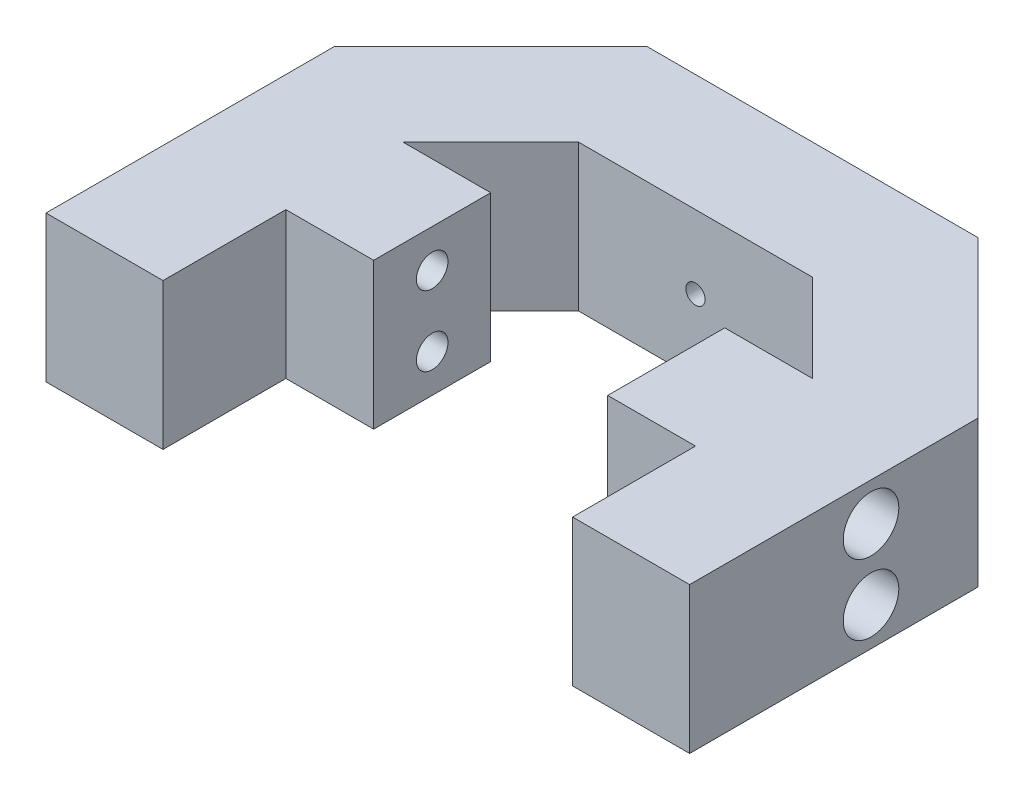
ISO-10303-21;
HEADER;
FILE_DESCRIPTION(('STEP AP214'),'2;1');
FILE_NAME('part.step','',(''),(''),'','','');
FILE_SCHEMA(('AUTOMOTIVE_DESIGN { 1 0 10303 214 1 1 1 1 }'));
ENDSEC;
DATA;
#1=APPLICATION_CONTEXT('core data for automotive mechanical design processes');
#2=APPLICATION_PROTOCOL_DEFINITION('international standard','automotive_design',2000,#1);
#3=PRODUCT_CONTEXT('',#1,'mechanical');
#4=PRODUCT('Part','Part','',(#3));
#5=PRODUCT_RELATED_PRODUCT_CATEGORY('part','',(#4));
#6=PRODUCT_DEFINITION_FORMATION('','',#4);
#7=PRODUCT_DEFINITION_CONTEXT('part definition',#1,'design');
#8=PRODUCT_DEFINITION('design','',#6,#7);
#9=PRODUCT_DEFINITION_SHAPE('','',#8);
#10=(LENGTH_UNIT() NAMED_UNIT(*) SI_UNIT(.MILLI.,.METRE.));
#11=(NAMED_UNIT(*) PLANE_ANGLE_UNIT() SI_UNIT($,.RADIAN.));
#12=(NAMED_UNIT(*) SI_UNIT($,.STERADIAN.) SOLID_ANGLE_UNIT());
#13=UNCERTAINTY_MEASURE_WITH_UNIT(LENGTH_MEASURE(1.E-05),#10,'distance_accuracy_value','');
#14=(GEOMETRIC_REPRESENTATION_CONTEXT(3) GLOBAL_UNCERTAINTY_ASSIGNED_CONTEXT((#13)) GLOBAL_UNIT_ASSIGNED_CONTEXT((#10,
#11,#12)) REPRESENTATION_CONTEXT('',''));
#15=CARTESIAN_POINT('',(0.,0.,0.));
#16=DIRECTION('',(0.,0.,1.));
#17=DIRECTION('',(1.,0.,0.));
#18=AXIS2_PLACEMENT_3D('',#15,#16,#17);
#19=CARTESIAN_POINT('',(55.,6.5,25.));
#20=DIRECTION('',(-1.,0.,0.));
#21=DIRECTION('',(0.,0.,1.));
#22=AXIS2_PLACEMENT_3D('',#19,#20,#21);
#23=CYLINDRICAL_SURFACE('',#22,2.7);
#24=CARTESIAN_POINT('',(-20.,6.5,25.));
#25=DIRECTION('',(1.,0.,0.));
#26=DIRECTION('',(0.,0.,-1.));
#27=AXIS2_PLACEMENT_3D('',#24,#25,#26);
#28=CIRCLE('',#27,2.7);
#29=CARTESIAN_POINT('',(-20.,6.5,22.3));
#30=VERTEX_POINT('',#29);
#31=EDGE_CURVE('E229',#30,#30,#28,.T.);
#32=ORIENTED_EDGE('',*,*,#31,.T.);
#33=EDGE_LOOP('',(#32));
#34=FACE_BOUND('',#33,.T.);
#35=CARTESIAN_POINT('',(-46.,6.5,25.));
#36=DIRECTION('',(-1.,0.,0.));
#37=DIRECTION('',(0.,0.,1.));
#38=AXIS2_PLACEMENT_3D('',#35,#36,#37);
#39=CIRCLE('',#38,2.7);
#40=CARTESIAN_POINT('',(-46.,6.5,27.7));
#41=VERTEX_POINT('',#40);
#42=EDGE_CURVE('E39',#41,#41,#39,.F.);
#43=ORIENTED_EDGE('',*,*,#42,.F.);
#44=EDGE_LOOP('',(#43));
#45=FACE_BOUND('',#44,.T.);
#46=ADVANCED_FACE('F35',(#34,#45),#23,.F.);
#47=CARTESIAN_POINT('',(55.,18.5,25.));
#48=DIRECTION('',(-1.,0.,0.));
#49=DIRECTION('',(0.,0.,1.));
#50=AXIS2_PLACEMENT_3D('',#47,#48,#49);
#51=CYLINDRICAL_SURFACE('',#50,2.7);
#52=CARTESIAN_POINT('',(-20.,18.5,25.));
#53=DIRECTION('',(1.,0.,0.));
#54=DIRECTION('',(0.,0.,-1.));
#55=AXIS2_PLACEMENT_3D('',#52,#53,#54);
#56=CIRCLE('',#55,2.7);
#57=CARTESIAN_POINT('',(-20.,18.5,22.3));
#58=VERTEX_POINT('',#57);
#59=EDGE_CURVE('E234',#58,#58,#56,.T.);
#60=ORIENTED_EDGE('',*,*,#59,.T.);
#61=EDGE_LOOP('',(#60));
#62=FACE_BOUND('',#61,.T.);
#63=CARTESIAN_POINT('',(-46.,18.5,25.));
#64=DIRECTION('',(-1.,0.,0.));
#65=DIRECTION('',(0.,0.,1.));
#66=AXIS2_PLACEMENT_3D('',#63,#64,#65);
#67=CIRCLE('',#66,2.7);
#68=CARTESIAN_POINT('',(-46.,18.5,27.7));
#69=VERTEX_POINT('',#68);
#70=EDGE_CURVE('E207',#69,#69,#67,.F.);
#71=ORIENTED_EDGE('',*,*,#70,.F.);
#72=EDGE_LOOP('',(#71));
#73=FACE_BOUND('',#72,.T.);
#74=ADVANCED_FACE('F368',(#62,#73),#51,.F.);
#75=CARTESIAN_POINT('',(20.,6.5,25.));
#76=DIRECTION('',(-1.,0.,0.));
#77=DIRECTION('',(0.,0.,1.));
#78=AXIS2_PLACEMENT_3D('',#75,#76,#77);
#79=CIRCLE('',#78,2.7);
#80=CARTESIAN_POINT('',(20.,6.5,27.7));
#81=VERTEX_POINT('',#80);
#82=EDGE_CURVE('E233',#81,#81,#79,.T.);
#83=ORIENTED_EDGE('',*,*,#82,.T.);
#84=EDGE_LOOP('',(#83));
#85=FACE_BOUND('',#84,.T.);
#86=CARTESIAN_POINT('',(46.,6.5,25.));
#87=DIRECTION('',(1.,0.,0.));
#88=DIRECTION('',(0.,0.,-1.));
#89=AXIS2_PLACEMENT_3D('',#86,#87,#88);
#90=CIRCLE('',#89,2.7);
#91=CARTESIAN_POINT('',(46.,6.5,22.3));
#92=VERTEX_POINT('',#91);
#93=EDGE_CURVE('E353',#92,#92,#90,.F.);
#94=ORIENTED_EDGE('',*,*,#93,.F.);
#95=EDGE_LOOP('',(#94));
#96=FACE_BOUND('',#95,.T.);
#97=ADVANCED_FACE('F371',(#85,#96),#23,.F.);
#98=CARTESIAN_POINT('',(20.,18.5,25.));
#99=DIRECTION('',(-1.,0.,0.));
#100=DIRECTION('',(0.,0.,1.));
#101=AXIS2_PLACEMENT_3D('',#98,#99,#100);
#102=CIRCLE('',#101,2.7);
#103=CARTESIAN_POINT('',(20.,18.5,27.7));
#104=VERTEX_POINT('',#103);
#105=EDGE_CURVE('E232',#104,#104,#102,.T.);
#106=ORIENTED_EDGE('',*,*,#105,.T.);
#107=EDGE_LOOP('',(#106));
#108=FACE_BOUND('',#107,.T.);
#109=CARTESIAN_POINT('',(46.,18.5,25.));
#110=DIRECTION('',(1.,0.,0.));
#111=DIRECTION('',(0.,0.,-1.));
#112=AXIS2_PLACEMENT_3D('',#109,#110,#111);
#113=CIRCLE('',#112,2.7);
#114=CARTESIAN_POINT('',(46.,18.5,22.3));
#115=VERTEX_POINT('',#114);
#116=EDGE_CURVE('E219',#115,#115,#113,.F.);
#117=ORIENTED_EDGE('',*,*,#116,.F.);
#118=EDGE_LOOP('',(#117));
#119=FACE_BOUND('',#118,.T.);
#120=ADVANCED_FACE('F377',(#108,#119),#51,.F.);
#121=CARTESIAN_POINT('',(0.,12.5,48.));
#122=DIRECTION('',(0.,0.,-1.));
#123=DIRECTION('',(-1.,0.,0.));
#124=AXIS2_PLACEMENT_3D('',#121,#122,#123);
#125=CYLINDRICAL_SURFACE('',#124,1.65);
#126=CARTESIAN_POINT('',(0.,12.5,0.));
#127=DIRECTION('',(0.,0.,1.));
#128=DIRECTION('',(1.,0.,0.));
#129=AXIS2_PLACEMENT_3D('',#126,#127,#128);
#130=CIRCLE('',#129,1.65);
#131=CARTESIAN_POINT('',(1.65,12.5,0.));
#132=VERTEX_POINT('',#131);
#133=EDGE_CURVE('E254',#132,#132,#130,.T.);
#134=ORIENTED_EDGE('',*,*,#133,.T.);
#135=EDGE_LOOP('',(#134));
#136=FACE_BOUND('',#135,.T.);
#137=CARTESIAN_POINT('',(0.,12.5,-12.));
#138=DIRECTION('',(0.,0.,-1.));
#139=DIRECTION('',(-1.,0.,0.));
#140=AXIS2_PLACEMENT_3D('',#137,#138,#139);
#141=CIRCLE('',#140,1.65);
#142=CARTESIAN_POINT('',(-1.65,12.5,-12.));
#143=VERTEX_POINT('',#142);
#144=EDGE_CURVE('E241',#143,#143,#141,.F.);
#145=ORIENTED_EDGE('',*,*,#144,.F.);
#146=EDGE_LOOP('',(#145));
#147=FACE_BOUND('',#146,.T.);
#148=ADVANCED_FACE('F384',(#136,#147),#125,.F.);
#149=CARTESIAN_POINT('',(35.,25.,15.));
#150=DIRECTION('',(-0.707106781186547,0.,0.707106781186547));
#151=DIRECTION('',(0.707106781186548,0.,0.707106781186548));
#152=AXIS2_PLACEMENT_3D('',#149,#150,#151);
#153=PLANE('',#152);
#154=DIRECTION('',(-0.707106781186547,0.,-0.707106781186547));
#155=VECTOR('',#154,1.);
#156=CARTESIAN_POINT('',(35.,0.,15.));
#157=LINE('',#156,#155);
#158=CARTESIAN_POINT('',(35.,0.,15.));
#159=VERTEX_POINT('',#158);
#160=CARTESIAN_POINT('',(20.,0.,0.));
#161=VERTEX_POINT('',#160);
#162=EDGE_CURVE('E290',#159,#161,#157,.T.);
#163=ORIENTED_EDGE('',*,*,#162,.F.);
#164=DIRECTION('',(0.,-1.,0.));
#165=VECTOR('',#164,1.);
#166=CARTESIAN_POINT('',(35.,25.,15.));
#167=LINE('',#166,#165);
#168=CARTESIAN_POINT('',(35.,25.,15.));
#169=VERTEX_POINT('',#168);
#170=EDGE_CURVE('E11',#169,#159,#167,.T.);
#171=ORIENTED_EDGE('',*,*,#170,.F.);
#172=DIRECTION('',(-0.707106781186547,0.,-0.707106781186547));
#173=VECTOR('',#172,1.);
#174=CARTESIAN_POINT('',(35.,25.,15.));
#175=LINE('',#174,#173);
#176=CARTESIAN_POINT('',(20.,25.,0.));
#177=VERTEX_POINT('',#176);
#178=EDGE_CURVE('E169',#169,#177,#175,.T.);
#179=ORIENTED_EDGE('',*,*,#178,.T.);
#180=DIRECTION('',(0.,-1.,0.));
#181=VECTOR('',#180,1.);
#182=CARTESIAN_POINT('',(20.,25.,0.));
#183=LINE('',#182,#181);
#184=EDGE_CURVE('E314',#177,#161,#183,.T.);
#185=ORIENTED_EDGE('',*,*,#184,.T.);
#186=EDGE_LOOP('',(#163,#171,#179,#185));
#187=FACE_BOUND('',#186,.T.);
#188=ADVANCED_FACE('F37',(#187),#153,.T.);
#189=CARTESIAN_POINT('',(35.,25.,40.));
#190=DIRECTION('',(-1.,0.,0.));
#191=DIRECTION('',(0.,0.,1.));
#192=AXIS2_PLACEMENT_3D('',#189,#190,#191);
#193=PLANE('',#192);
#194=DIRECTION('',(0.,1.,0.));
#195=VECTOR('',#194,1.);
#196=CARTESIAN_POINT('',(35.,-25.,35.));
#197=LINE('',#196,#195);
#198=CARTESIAN_POINT('',(35.,0.,35.));
#199=VERTEX_POINT('',#198);
#200=CARTESIAN_POINT('',(35.,25.,35.));
#201=VERTEX_POINT('',#200);
#202=EDGE_CURVE('E167',#199,#201,#197,.T.);
#203=ORIENTED_EDGE('',*,*,#202,.F.);
#204=DIRECTION('',(0.,0.,-1.));
#205=VECTOR('',#204,1.);
#206=CARTESIAN_POINT('',(35.,0.,40.));
#207=LINE('',#206,#205);
#208=CARTESIAN_POINT('',(35.,0.,56.));
#209=VERTEX_POINT('',#208);
#210=EDGE_CURVE('E161',#209,#199,#207,.T.);
#211=ORIENTED_EDGE('',*,*,#210,.F.);
#212=DIRECTION('',(0.,-1.,0.));
#213=VECTOR('',#212,1.);
#214=CARTESIAN_POINT('',(35.,25.,56.));
#215=LINE('',#214,#213);
#216=CARTESIAN_POINT('',(35.,25.,56.));
#217=VERTEX_POINT('',#216);
#218=EDGE_CURVE('E166',#217,#209,#215,.T.);
#219=ORIENTED_EDGE('',*,*,#218,.F.);
#220=DIRECTION('',(0.,0.,-1.));
#221=VECTOR('',#220,1.);
#222=CARTESIAN_POINT('',(35.,25.,40.));
#223=LINE('',#222,#221);
#224=EDGE_CURVE('E312',#217,#201,#223,.T.);
#225=ORIENTED_EDGE('',*,*,#224,.T.);
#226=EDGE_LOOP('',(#203,#211,#219,#225));
#227=FACE_BOUND('',#226,.T.);
#228=ADVANCED_FACE('F163',(#227),#193,.T.);
#229=CARTESIAN_POINT('',(55.,25.,6.71572875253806));
#230=DIRECTION('',(1.,0.,0.));
#231=DIRECTION('',(0.,0.,-1.));
#232=AXIS2_PLACEMENT_3D('',#229,#230,#231);
#233=PLANE('',#232);
#234=CARTESIAN_POINT('',(55.,18.5,25.));
#235=DIRECTION('',(1.,0.,0.));
#236=DIRECTION('',(0.,0.,-1.));
#237=AXIS2_PLACEMENT_3D('',#234,#235,#236);
#238=CIRCLE('',#237,4.75);
#239=CARTESIAN_POINT('',(55.,18.5,20.25));
#240=VERTEX_POINT('',#239);
#241=EDGE_CURVE('E220',#240,#240,#238,.T.);
#242=ORIENTED_EDGE('',*,*,#241,.F.);
#243=EDGE_LOOP('',(#242));
#244=FACE_BOUND('',#243,.T.);
#245=CARTESIAN_POINT('',(55.,6.5,25.));
#246=DIRECTION('',(1.,0.,0.));
#247=DIRECTION('',(0.,0.,-1.));
#248=AXIS2_PLACEMENT_3D('',#245,#246,#247);
#249=CIRCLE('',#248,4.75);
#250=CARTESIAN_POINT('',(55.,6.5,20.25));
#251=VERTEX_POINT('',#250);
#252=EDGE_CURVE('E226',#251,#251,#249,.T.);
#253=ORIENTED_EDGE('',*,*,#252,.F.);
#254=EDGE_LOOP('',(#253));
#255=FACE_BOUND('',#254,.T.);
#256=DIRECTION('',(0.,0.,1.));
#257=VECTOR('',#256,1.);
#258=CARTESIAN_POINT('',(55.,0.,6.71572875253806));
#259=LINE('',#258,#257);
#260=CARTESIAN_POINT('',(55.,0.,6.71572875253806));
#261=VERTEX_POINT('',#260);
#262=CARTESIAN_POINT('',(55.,0.,56.));
#263=VERTEX_POINT('',#262);
#264=EDGE_CURVE('E170',#261,#263,#259,.T.);
#265=ORIENTED_EDGE('',*,*,#264,.F.);
#266=DIRECTION('',(0.,-1.,0.));
#267=VECTOR('',#266,1.);
#268=CARTESIAN_POINT('',(55.,25.,6.71572875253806));
#269=LINE('',#268,#267);
#270=CARTESIAN_POINT('',(55.,25.,6.71572875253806));
#271=VERTEX_POINT('',#270);
#272=EDGE_CURVE('E44',#271,#261,#269,.T.);
#273=ORIENTED_EDGE('',*,*,#272,.F.);
#274=DIRECTION('',(0.,0.,1.));
#275=VECTOR('',#274,1.);
#276=CARTESIAN_POINT('',(55.,25.,6.71572875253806));
#277=LINE('',#276,#275);
#278=CARTESIAN_POINT('',(55.,25.,56.));
#279=VERTEX_POINT('',#278);
#280=EDGE_CURVE('E310',#271,#279,#277,.T.);
#281=ORIENTED_EDGE('',*,*,#280,.T.);
#282=DIRECTION('',(0.,1.,0.));
#283=VECTOR('',#282,1.);
#284=CARTESIAN_POINT('',(55.,25.,56.));
#285=LINE('',#284,#283);
#286=EDGE_CURVE('E181',#263,#279,#285,.T.);
#287=ORIENTED_EDGE('',*,*,#286,.F.);
#288=EDGE_LOOP('',(#265,#273,#281,#287));
#289=FACE_BOUND('',#288,.T.);
#290=ADVANCED_FACE('F473',(#244,#255,#289),#233,.T.);
#291=CARTESIAN_POINT('',(28.2842712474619,25.,-20.));
#292=DIRECTION('',(0.707106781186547,0.,-0.707106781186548));
#293=DIRECTION('',(-0.707106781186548,0.,-0.707106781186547));
#294=AXIS2_PLACEMENT_3D('',#291,#292,#293);
#295=PLANE('',#294);
#296=DIRECTION('',(0.707106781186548,0.,0.707106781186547));
#297=VECTOR('',#296,1.);
#298=CARTESIAN_POINT('',(28.2842712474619,0.,-20.));
#299=LINE('',#298,#297);
#300=CARTESIAN_POINT('',(28.2842712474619,0.,-20.));
#301=VERTEX_POINT('',#300);
#302=EDGE_CURVE('E330',#301,#261,#299,.T.);
#303=ORIENTED_EDGE('',*,*,#302,.F.);
#304=DIRECTION('',(0.,-1.,0.));
#305=VECTOR('',#304,1.);
#306=CARTESIAN_POINT('',(28.2842712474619,25.,-20.));
#307=LINE('',#306,#305);
#308=CARTESIAN_POINT('',(28.2842712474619,25.,-20.));
#309=VERTEX_POINT('',#308);
#310=EDGE_CURVE('E334',#309,#301,#307,.T.);
#311=ORIENTED_EDGE('',*,*,#310,.F.);
#312=DIRECTION('',(0.707106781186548,0.,0.707106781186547));
#313=VECTOR('',#312,1.);
#314=CARTESIAN_POINT('',(28.2842712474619,25.,-20.));
#315=LINE('',#314,#313);
#316=EDGE_CURVE('E307',#309,#271,#315,.T.);
#317=ORIENTED_EDGE('',*,*,#316,.T.);
#318=ORIENTED_EDGE('',*,*,#272,.T.);
#319=EDGE_LOOP('',(#303,#311,#317,#318));
#320=FACE_BOUND('',#319,.T.);
#321=ADVANCED_FACE('F476',(#320),#295,.T.);
#322=CARTESIAN_POINT('',(-28.2842712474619,25.,-20.));
#323=DIRECTION('',(0.,0.,-1.));
#324=DIRECTION('',(-1.,0.,0.));
#325=AXIS2_PLACEMENT_3D('',#322,#323,#324);
#326=PLANE('',#325);
#327=CARTESIAN_POINT('',(0.,12.5,-20.));
#328=DIRECTION('',(0.,0.,-1.));
#329=DIRECTION('',(-1.,0.,0.));
#330=AXIS2_PLACEMENT_3D('',#327,#328,#329);
#331=CIRCLE('',#330,4.);
#332=CARTESIAN_POINT('',(-4.,12.5,-20.));
#333=VERTEX_POINT('',#332);
#334=EDGE_CURVE('E237',#333,#333,#331,.T.);
#335=ORIENTED_EDGE('',*,*,#334,.F.);
#336=EDGE_LOOP('',(#335));
#337=FACE_BOUND('',#336,.T.);
#338=DIRECTION('',(1.,0.,0.));
#339=VECTOR('',#338,1.);
#340=CARTESIAN_POINT('',(-28.2842712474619,0.,-20.));
#341=LINE('',#340,#339);
#342=CARTESIAN_POINT('',(-28.2842712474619,0.,-20.));
#343=VERTEX_POINT('',#342);
#344=EDGE_CURVE('E327',#343,#301,#341,.T.);
#345=ORIENTED_EDGE('',*,*,#344,.F.);
#346=DIRECTION('',(0.,-1.,0.));
#347=VECTOR('',#346,1.);
#348=CARTESIAN_POINT('',(-28.2842712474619,25.,-20.));
#349=LINE('',#348,#347);
#350=CARTESIAN_POINT('',(-28.2842712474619,25.,-20.));
#351=VERTEX_POINT('',#350);
#352=EDGE_CURVE('E336',#351,#343,#349,.T.);
#353=ORIENTED_EDGE('',*,*,#352,.F.);
#354=DIRECTION('',(1.,0.,0.));
#355=VECTOR('',#354,1.);
#356=CARTESIAN_POINT('',(-28.2842712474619,25.,-20.));
#357=LINE('',#356,#355);
#358=EDGE_CURVE('E304',#351,#309,#357,.T.);
#359=ORIENTED_EDGE('',*,*,#358,.T.);
#360=ORIENTED_EDGE('',*,*,#310,.T.);
#361=EDGE_LOOP('',(#345,#353,#359,#360));
#362=FACE_BOUND('',#361,.T.);
#363=ADVANCED_FACE('F703',(#337,#362),#326,.T.);
#364=CARTESIAN_POINT('',(-28.2842712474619,25.,-20.));
#365=DIRECTION('',(0.707106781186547,0.,0.707106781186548));
#366=DIRECTION('',(0.707106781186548,0.,-0.707106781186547));
#367=AXIS2_PLACEMENT_3D('',#364,#365,#366);
#368=PLANE('',#367);
#369=DIRECTION('',(-0.707106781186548,0.,0.707106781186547));
#370=VECTOR('',#369,1.);
#371=CARTESIAN_POINT('',(-28.2842712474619,0.,-20.));
#372=LINE('',#371,#370);
#373=CARTESIAN_POINT('',(-55.,0.,6.71572875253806));
#374=VERTEX_POINT('',#373);
#375=EDGE_CURVE('E325',#343,#374,#372,.T.);
#376=ORIENTED_EDGE('',*,*,#375,.T.);
#377=DIRECTION('',(0.,-1.,0.));
#378=VECTOR('',#377,1.);
#379=CARTESIAN_POINT('',(-55.,25.,6.71572875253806));
#380=LINE('',#379,#378);
#381=CARTESIAN_POINT('',(-55.,25.,6.71572875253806));
#382=VERTEX_POINT('',#381);
#383=EDGE_CURVE('E338',#382,#374,#380,.T.);
#384=ORIENTED_EDGE('',*,*,#383,.F.);
#385=DIRECTION('',(-0.707106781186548,0.,0.707106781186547));
#386=VECTOR('',#385,1.);
#387=CARTESIAN_POINT('',(-28.2842712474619,25.,-20.));
#388=LINE('',#387,#386);
#389=EDGE_CURVE('E302',#351,#382,#388,.T.);
#390=ORIENTED_EDGE('',*,*,#389,.F.);
#391=ORIENTED_EDGE('',*,*,#352,.T.);
#392=EDGE_LOOP('',(#376,#384,#390,#391));
#393=FACE_BOUND('',#392,.T.);
#394=ADVANCED_FACE('F467',(#393),#368,.F.);
#395=CARTESIAN_POINT('',(-55.,25.,6.71572875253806));
#396=DIRECTION('',(1.,0.,0.));
#397=DIRECTION('',(0.,0.,-1.));
#398=AXIS2_PLACEMENT_3D('',#395,#396,#397);
#399=PLANE('',#398);
#400=CARTESIAN_POINT('',(-55.,18.5,25.));
#401=DIRECTION('',(-1.,0.,0.));
#402=DIRECTION('',(0.,0.,1.));
#403=AXIS2_PLACEMENT_3D('',#400,#401,#402);
#404=CIRCLE('',#403,4.75);
#405=CARTESIAN_POINT('',(-55.,18.5,29.75));
#406=VERTEX_POINT('',#405);
#407=EDGE_CURVE('E208',#406,#406,#404,.T.);
#408=ORIENTED_EDGE('',*,*,#407,.F.);
#409=EDGE_LOOP('',(#408));
#410=FACE_BOUND('',#409,.T.);
#411=CARTESIAN_POINT('',(-55.,6.5,25.));
#412=DIRECTION('',(-1.,0.,0.));
#413=DIRECTION('',(0.,0.,1.));
#414=AXIS2_PLACEMENT_3D('',#411,#412,#413);
#415=CIRCLE('',#414,4.75);
#416=CARTESIAN_POINT('',(-55.,6.5,29.75));
#417=VERTEX_POINT('',#416);
#418=EDGE_CURVE('E203',#417,#417,#415,.T.);
#419=ORIENTED_EDGE('',*,*,#418,.F.);
#420=EDGE_LOOP('',(#419));
#421=FACE_BOUND('',#420,.T.);
#422=DIRECTION('',(0.,0.,1.));
#423=VECTOR('',#422,1.);
#424=CARTESIAN_POINT('',(-55.,0.,6.71572875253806));
#425=LINE('',#424,#423);
#426=CARTESIAN_POINT('',(-55.,0.,56.));
#427=VERTEX_POINT('',#426);
#428=EDGE_CURVE('E323',#374,#427,#425,.T.);
#429=ORIENTED_EDGE('',*,*,#428,.T.);
#430=DIRECTION('',(0.,-1.,0.));
#431=VECTOR('',#430,1.);
#432=CARTESIAN_POINT('',(-55.,25.,56.));
#433=LINE('',#432,#431);
#434=CARTESIAN_POINT('',(-55.,25.,56.));
#435=VERTEX_POINT('',#434);
#436=EDGE_CURVE('E191',#435,#427,#433,.T.);
#437=ORIENTED_EDGE('',*,*,#436,.F.);
#438=DIRECTION('',(0.,0.,1.));
#439=VECTOR('',#438,1.);
#440=CARTESIAN_POINT('',(-55.,25.,6.71572875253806));
#441=LINE('',#440,#439);
#442=EDGE_CURVE('E300',#382,#435,#441,.T.);
#443=ORIENTED_EDGE('',*,*,#442,.F.);
#444=ORIENTED_EDGE('',*,*,#383,.T.);
#445=EDGE_LOOP('',(#429,#437,#443,#444));
#446=FACE_BOUND('',#445,.T.);
#447=ADVANCED_FACE('F460',(#410,#421,#446),#399,.F.);
#448=CARTESIAN_POINT('',(-35.,25.,40.));
#449=DIRECTION('',(-1.,0.,0.));
#450=DIRECTION('',(0.,0.,1.));
#451=AXIS2_PLACEMENT_3D('',#448,#449,#450);
#452=PLANE('',#451);
#453=DIRECTION('',(0.,0.,-1.));
#454=VECTOR('',#453,1.);
#455=CARTESIAN_POINT('',(-35.,0.,40.));
#456=LINE('',#455,#454);
#457=CARTESIAN_POINT('',(-35.,0.,56.));
#458=VERTEX_POINT('',#457);
#459=CARTESIAN_POINT('',(-35.,0.,35.));
#460=VERTEX_POINT('',#459);
#461=EDGE_CURVE('E57',#458,#460,#456,.T.);
#462=ORIENTED_EDGE('',*,*,#461,.T.);
#463=DIRECTION('',(0.,1.,0.));
#464=VECTOR('',#463,1.);
#465=CARTESIAN_POINT('',(-35.,-25.,35.));
#466=LINE('',#465,#464);
#467=CARTESIAN_POINT('',(-35.,25.,35.));
#468=VERTEX_POINT('',#467);
#469=EDGE_CURVE('E52',#460,#468,#466,.T.);
#470=ORIENTED_EDGE('',*,*,#469,.T.);
#471=DIRECTION('',(0.,0.,-1.));
#472=VECTOR('',#471,1.);
#473=CARTESIAN_POINT('',(-35.,25.,40.));
#474=LINE('',#473,#472);
#475=CARTESIAN_POINT('',(-35.,25.,56.));
#476=VERTEX_POINT('',#475);
#477=EDGE_CURVE('E298',#476,#468,#474,.T.);
#478=ORIENTED_EDGE('',*,*,#477,.F.);
#479=DIRECTION('',(0.,1.,0.));
#480=VECTOR('',#479,1.);
#481=CARTESIAN_POINT('',(-35.,25.,56.));
#482=LINE('',#481,#480);
#483=EDGE_CURVE('E197',#458,#476,#482,.T.);
#484=ORIENTED_EDGE('',*,*,#483,.F.);
#485=EDGE_LOOP('',(#462,#470,#478,#484));
#486=FACE_BOUND('',#485,.T.);
#487=ADVANCED_FACE('F456',(#486),#452,.F.);
#488=CARTESIAN_POINT('',(-35.,25.,15.));
#489=DIRECTION('',(-0.707106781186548,0.,-0.707106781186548));
#490=DIRECTION('',(-0.707106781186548,0.,0.707106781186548));
#491=AXIS2_PLACEMENT_3D('',#488,#489,#490);
#492=PLANE('',#491);
#493=DIRECTION('',(0.707106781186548,0.,-0.707106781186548));
#494=VECTOR('',#493,1.);
#495=CARTESIAN_POINT('',(-35.,0.,15.));
#496=LINE('',#495,#494);
#497=CARTESIAN_POINT('',(-35.,0.,15.));
#498=VERTEX_POINT('',#497);
#499=CARTESIAN_POINT('',(-20.,0.,0.));
#500=VERTEX_POINT('',#499);
#501=EDGE_CURVE('E319',#498,#500,#496,.T.);
#502=ORIENTED_EDGE('',*,*,#501,.T.);
#503=DIRECTION('',(0.,-1.,0.));
#504=VECTOR('',#503,1.);
#505=CARTESIAN_POINT('',(-20.,25.,0.));
#506=LINE('',#505,#504);
#507=CARTESIAN_POINT('',(-20.,25.,0.));
#508=VERTEX_POINT('',#507);
#509=EDGE_CURVE('E344',#508,#500,#506,.T.);
#510=ORIENTED_EDGE('',*,*,#509,.F.);
#511=DIRECTION('',(0.707106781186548,0.,-0.707106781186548));
#512=VECTOR('',#511,1.);
#513=CARTESIAN_POINT('',(-35.,25.,15.));
#514=LINE('',#513,#512);
#515=CARTESIAN_POINT('',(-35.,25.,15.));
#516=VERTEX_POINT('',#515);
#517=EDGE_CURVE('E296',#516,#508,#514,.T.);
#518=ORIENTED_EDGE('',*,*,#517,.F.);
#519=DIRECTION('',(0.,-1.,0.));
#520=VECTOR('',#519,1.);
#521=CARTESIAN_POINT('',(-35.,25.,15.));
#522=LINE('',#521,#520);
#523=EDGE_CURVE('E341',#516,#498,#522,.T.);
#524=ORIENTED_EDGE('',*,*,#523,.T.);
#525=EDGE_LOOP('',(#502,#510,#518,#524));
#526=FACE_BOUND('',#525,.T.);
#527=ADVANCED_FACE('F459',(#526),#492,.F.);
#528=CARTESIAN_POINT('',(20.,25.,0.));
#529=DIRECTION('',(0.,0.,1.));
#530=DIRECTION('',(1.,0.,0.));
#531=AXIS2_PLACEMENT_3D('',#528,#529,#530);
#532=PLANE('',#531);
#533=ORIENTED_EDGE('',*,*,#133,.F.);
#534=EDGE_LOOP('',(#533));
#535=FACE_BOUND('',#534,.T.);
#536=DIRECTION('',(-1.,0.,0.));
#537=VECTOR('',#536,1.);
#538=CARTESIAN_POINT('',(20.,0.,0.));
#539=LINE('',#538,#537);
#540=EDGE_CURVE('E316',#161,#500,#539,.T.);
#541=ORIENTED_EDGE('',*,*,#540,.F.);
#542=ORIENTED_EDGE('',*,*,#184,.F.);
#543=DIRECTION('',(-1.,0.,0.));
#544=VECTOR('',#543,1.);
#545=CARTESIAN_POINT('',(20.,25.,0.));
#546=LINE('',#545,#544);
#547=EDGE_CURVE('E293',#177,#508,#546,.T.);
#548=ORIENTED_EDGE('',*,*,#547,.T.);
#549=ORIENTED_EDGE('',*,*,#509,.T.);
#550=EDGE_LOOP('',(#541,#542,#548,#549));
#551=FACE_BOUND('',#550,.T.);
#552=ADVANCED_FACE('F450',(#535,#551),#532,.T.);
#553=CARTESIAN_POINT('',(0.,25.,0.));
#554=DIRECTION('',(0.,-1.,0.));
#555=DIRECTION('',(0.,0.,-1.));
#556=AXIS2_PLACEMENT_3D('',#553,#554,#555);
#557=PLANE('',#556);
#558=ORIENTED_EDGE('',*,*,#178,.F.);
#559=DIRECTION('',(-1.,0.,0.));
#560=VECTOR('',#559,1.);
#561=CARTESIAN_POINT('',(35.,25.,15.));
#562=LINE('',#561,#560);
#563=CARTESIAN_POINT('',(20.,25.,15.));
#564=VERTEX_POINT('',#563);
#565=EDGE_CURVE('E251',#169,#564,#562,.T.);
#566=ORIENTED_EDGE('',*,*,#565,.T.);
#567=DIRECTION('',(0.,0.,1.));
#568=VECTOR('',#567,1.);
#569=CARTESIAN_POINT('',(20.,25.,15.));
#570=LINE('',#569,#568);
#571=CARTESIAN_POINT('',(20.,25.,35.));
#572=VERTEX_POINT('',#571);
#573=EDGE_CURVE('E248',#564,#572,#570,.T.);
#574=ORIENTED_EDGE('',*,*,#573,.T.);
#575=DIRECTION('',(1.,0.,0.));
#576=VECTOR('',#575,1.);
#577=CARTESIAN_POINT('',(35.,25.,35.));
#578=LINE('',#577,#576);
#579=EDGE_CURVE('E244',#572,#201,#578,.T.);
#580=ORIENTED_EDGE('',*,*,#579,.T.);
#581=ORIENTED_EDGE('',*,*,#224,.F.);
#582=DIRECTION('',(-1.,0.,0.));
#583=VECTOR('',#582,1.);
#584=CARTESIAN_POINT('',(35.,25.,56.));
#585=LINE('',#584,#583);
#586=EDGE_CURVE('E186',#279,#217,#585,.T.);
#587=ORIENTED_EDGE('',*,*,#586,.F.);
#588=ORIENTED_EDGE('',*,*,#280,.F.);
#589=ORIENTED_EDGE('',*,*,#316,.F.);
#590=ORIENTED_EDGE('',*,*,#358,.F.);
#591=ORIENTED_EDGE('',*,*,#389,.T.);
#592=ORIENTED_EDGE('',*,*,#442,.T.);
#593=DIRECTION('',(-1.,0.,0.));
#594=VECTOR('',#593,1.);
#595=CARTESIAN_POINT('',(-55.,25.,56.));
#596=LINE('',#595,#594);
#597=EDGE_CURVE('E200',#476,#435,#596,.T.);
#598=ORIENTED_EDGE('',*,*,#597,.F.);
#599=ORIENTED_EDGE('',*,*,#477,.T.);
#600=DIRECTION('',(1.,0.,0.));
#601=VECTOR('',#600,1.);
#602=CARTESIAN_POINT('',(-35.,25.,35.));
#603=LINE('',#602,#601);
#604=CARTESIAN_POINT('',(-20.,25.,35.));
#605=VERTEX_POINT('',#604);
#606=EDGE_CURVE('E267',#468,#605,#603,.T.);
#607=ORIENTED_EDGE('',*,*,#606,.T.);
#608=DIRECTION('',(0.,0.,-1.));
#609=VECTOR('',#608,1.);
#610=CARTESIAN_POINT('',(-20.,25.,15.));
#611=LINE('',#610,#609);
#612=CARTESIAN_POINT('',(-20.,25.,15.));
#613=VERTEX_POINT('',#612);
#614=EDGE_CURVE('E272',#605,#613,#611,.T.);
#615=ORIENTED_EDGE('',*,*,#614,.T.);
#616=DIRECTION('',(-1.,0.,0.));
#617=VECTOR('',#616,1.);
#618=CARTESIAN_POINT('',(-35.,25.,15.));
#619=LINE('',#618,#617);
#620=EDGE_CURVE('E268',#613,#516,#619,.T.);
#621=ORIENTED_EDGE('',*,*,#620,.T.);
#622=ORIENTED_EDGE('',*,*,#517,.T.);
#623=ORIENTED_EDGE('',*,*,#547,.F.);
#624=EDGE_LOOP('',(#558,#566,#574,#580,#581,#587,#588,#589,#590,#591,#592,#598,#599,#607,#615,
#621,#622,#623));
#625=FACE_BOUND('',#624,.T.);
#626=ADVANCED_FACE('F443',(#625),#557,.F.);
#627=CARTESIAN_POINT('',(0.,0.,0.));
#628=DIRECTION('',(0.,-1.,0.));
#629=DIRECTION('',(0.,0.,-1.));
#630=AXIS2_PLACEMENT_3D('',#627,#628,#629);
#631=PLANE('',#630);
#632=ORIENTED_EDGE('',*,*,#162,.T.);
#633=ORIENTED_EDGE('',*,*,#540,.T.);
#634=ORIENTED_EDGE('',*,*,#501,.F.);
#635=DIRECTION('',(-1.,0.,0.));
#636=VECTOR('',#635,1.);
#637=CARTESIAN_POINT('',(-35.,0.,15.));
#638=LINE('',#637,#636);
#639=CARTESIAN_POINT('',(-20.,0.,15.));
#640=VERTEX_POINT('',#639);
#641=EDGE_CURVE('E280',#640,#498,#638,.T.);
#642=ORIENTED_EDGE('',*,*,#641,.F.);
#643=DIRECTION('',(0.,0.,-1.));
#644=VECTOR('',#643,1.);
#645=CARTESIAN_POINT('',(-20.,0.,15.));
#646=LINE('',#645,#644);
#647=CARTESIAN_POINT('',(-20.,0.,35.));
#648=VERTEX_POINT('',#647);
#649=EDGE_CURVE('E284',#648,#640,#646,.T.);
#650=ORIENTED_EDGE('',*,*,#649,.F.);
#651=DIRECTION('',(1.,0.,0.));
#652=VECTOR('',#651,1.);
#653=CARTESIAN_POINT('',(-35.,0.,35.));
#654=LINE('',#653,#652);
#655=EDGE_CURVE('E271',#460,#648,#654,.T.);
#656=ORIENTED_EDGE('',*,*,#655,.F.);
#657=ORIENTED_EDGE('',*,*,#461,.F.);
#658=DIRECTION('',(1.,0.,0.));
#659=VECTOR('',#658,1.);
#660=CARTESIAN_POINT('',(-55.,0.,56.));
#661=LINE('',#660,#659);
#662=EDGE_CURVE('E194',#427,#458,#661,.T.);
#663=ORIENTED_EDGE('',*,*,#662,.F.);
#664=ORIENTED_EDGE('',*,*,#428,.F.);
#665=ORIENTED_EDGE('',*,*,#375,.F.);
#666=ORIENTED_EDGE('',*,*,#344,.T.);
#667=ORIENTED_EDGE('',*,*,#302,.T.);
#668=ORIENTED_EDGE('',*,*,#264,.T.);
#669=DIRECTION('',(1.,0.,0.));
#670=VECTOR('',#669,1.);
#671=CARTESIAN_POINT('',(35.,0.,56.));
#672=LINE('',#671,#670);
#673=EDGE_CURVE('E173',#209,#263,#672,.T.);
#674=ORIENTED_EDGE('',*,*,#673,.F.);
#675=ORIENTED_EDGE('',*,*,#210,.T.);
#676=DIRECTION('',(1.,0.,0.));
#677=VECTOR('',#676,1.);
#678=CARTESIAN_POINT('',(35.,0.,35.));
#679=LINE('',#678,#677);
#680=CARTESIAN_POINT('',(20.,0.,35.));
#681=VERTEX_POINT('',#680);
#682=EDGE_CURVE('E262',#681,#199,#679,.T.);
#683=ORIENTED_EDGE('',*,*,#682,.F.);
#684=DIRECTION('',(0.,0.,1.));
#685=VECTOR('',#684,1.);
#686=CARTESIAN_POINT('',(20.,0.,15.));
#687=LINE('',#686,#685);
#688=CARTESIAN_POINT('',(20.,0.,15.));
#689=VERTEX_POINT('',#688);
#690=EDGE_CURVE('E247',#689,#681,#687,.T.);
#691=ORIENTED_EDGE('',*,*,#690,.F.);
#692=DIRECTION('',(-1.,0.,0.));
#693=VECTOR('',#692,1.);
#694=CARTESIAN_POINT('',(35.,0.,15.));
#695=LINE('',#694,#693);
#696=EDGE_CURVE('E258',#159,#689,#695,.T.);
#697=ORIENTED_EDGE('',*,*,#696,.F.);
#698=EDGE_LOOP('',(#632,#633,#634,#642,#650,#656,#657,#663,#664,#665,#666,#667,#668,#674,#675,
#683,#691,#697));
#699=FACE_BOUND('',#698,.T.);
#700=ADVANCED_FACE('F175',(#699),#631,.T.);
#701=CARTESIAN_POINT('',(-35.,-25.,35.));
#702=DIRECTION('',(0.,0.,1.));
#703=DIRECTION('',(1.,0.,0.));
#704=AXIS2_PLACEMENT_3D('',#701,#702,#703);
#705=PLANE('',#704);
#706=ORIENTED_EDGE('',*,*,#469,.F.);
#707=ORIENTED_EDGE('',*,*,#655,.T.);
#708=DIRECTION('',(0.,1.,0.));
#709=VECTOR('',#708,1.);
#710=CARTESIAN_POINT('',(-20.,-25.,35.));
#711=LINE('',#710,#709);
#712=EDGE_CURVE('E279',#648,#605,#711,.T.);
#713=ORIENTED_EDGE('',*,*,#712,.T.);
#714=ORIENTED_EDGE('',*,*,#606,.F.);
#715=EDGE_LOOP('',(#706,#707,#713,#714));
#716=FACE_BOUND('',#715,.T.);
#717=ADVANCED_FACE('F442',(#716),#705,.T.);
#718=CARTESIAN_POINT('',(-20.,-25.,15.));
#719=DIRECTION('',(1.,0.,0.));
#720=DIRECTION('',(0.,0.,-1.));
#721=AXIS2_PLACEMENT_3D('',#718,#719,#720);
#722=PLANE('',#721);
#723=ORIENTED_EDGE('',*,*,#59,.F.);
#724=EDGE_LOOP('',(#723));
#725=FACE_BOUND('',#724,.T.);
#726=ORIENTED_EDGE('',*,*,#31,.F.);
#727=EDGE_LOOP('',(#726));
#728=FACE_BOUND('',#727,.T.);
#729=ORIENTED_EDGE('',*,*,#712,.F.);
#730=ORIENTED_EDGE('',*,*,#649,.T.);
#731=DIRECTION('',(0.,1.,0.));
#732=VECTOR('',#731,1.);
#733=CARTESIAN_POINT('',(-20.,-25.,15.));
#734=LINE('',#733,#732);
#735=EDGE_CURVE('E283',#640,#613,#734,.T.);
#736=ORIENTED_EDGE('',*,*,#735,.T.);
#737=ORIENTED_EDGE('',*,*,#614,.F.);
#738=EDGE_LOOP('',(#729,#730,#736,#737));
#739=FACE_BOUND('',#738,.T.);
#740=ADVANCED_FACE('F584',(#725,#728,#739),#722,.T.);
#741=CARTESIAN_POINT('',(-35.,-25.,15.));
#742=DIRECTION('',(0.,0.,-1.));
#743=DIRECTION('',(-1.,0.,0.));
#744=AXIS2_PLACEMENT_3D('',#741,#742,#743);
#745=PLANE('',#744);
#746=ORIENTED_EDGE('',*,*,#735,.F.);
#747=ORIENTED_EDGE('',*,*,#641,.T.);
#748=ORIENTED_EDGE('',*,*,#523,.F.);
#749=ORIENTED_EDGE('',*,*,#620,.F.);
#750=EDGE_LOOP('',(#746,#747,#748,#749));
#751=FACE_BOUND('',#750,.T.);
#752=ADVANCED_FACE('F595',(#751),#745,.T.);
#753=CARTESIAN_POINT('',(20.,-25.,15.));
#754=DIRECTION('',(-1.,0.,0.));
#755=DIRECTION('',(0.,0.,1.));
#756=AXIS2_PLACEMENT_3D('',#753,#754,#755);
#757=PLANE('',#756);
#758=ORIENTED_EDGE('',*,*,#105,.F.);
#759=EDGE_LOOP('',(#758));
#760=FACE_BOUND('',#759,.T.);
#761=ORIENTED_EDGE('',*,*,#82,.F.);
#762=EDGE_LOOP('',(#761));
#763=FACE_BOUND('',#762,.T.);
#764=DIRECTION('',(0.,1.,0.));
#765=VECTOR('',#764,1.);
#766=CARTESIAN_POINT('',(20.,-25.,15.));
#767=LINE('',#766,#765);
#768=EDGE_CURVE('E261',#689,#564,#767,.T.);
#769=ORIENTED_EDGE('',*,*,#768,.F.);
#770=ORIENTED_EDGE('',*,*,#690,.T.);
#771=DIRECTION('',(0.,1.,0.));
#772=VECTOR('',#771,1.);
#773=CARTESIAN_POINT('',(20.,-25.,35.));
#774=LINE('',#773,#772);
#775=EDGE_CURVE('E257',#681,#572,#774,.T.);
#776=ORIENTED_EDGE('',*,*,#775,.T.);
#777=ORIENTED_EDGE('',*,*,#573,.F.);
#778=EDGE_LOOP('',(#769,#770,#776,#777));
#779=FACE_BOUND('',#778,.T.);
#780=ADVANCED_FACE('F605',(#760,#763,#779),#757,.T.);
#781=CARTESIAN_POINT('',(35.,-25.,35.));
#782=DIRECTION('',(0.,0.,1.));
#783=DIRECTION('',(1.,0.,0.));
#784=AXIS2_PLACEMENT_3D('',#781,#782,#783);
#785=PLANE('',#784);
#786=ORIENTED_EDGE('',*,*,#775,.F.);
#787=ORIENTED_EDGE('',*,*,#682,.T.);
#788=ORIENTED_EDGE('',*,*,#202,.T.);
#789=ORIENTED_EDGE('',*,*,#579,.F.);
#790=EDGE_LOOP('',(#786,#787,#788,#789));
#791=FACE_BOUND('',#790,.T.);
#792=ADVANCED_FACE('F614',(#791),#785,.T.);
#793=CARTESIAN_POINT('',(35.,-25.,15.));
#794=DIRECTION('',(0.,0.,-1.));
#795=DIRECTION('',(-1.,0.,0.));
#796=AXIS2_PLACEMENT_3D('',#793,#794,#795);
#797=PLANE('',#796);
#798=ORIENTED_EDGE('',*,*,#170,.T.);
#799=ORIENTED_EDGE('',*,*,#696,.T.);
#800=ORIENTED_EDGE('',*,*,#768,.T.);
#801=ORIENTED_EDGE('',*,*,#565,.F.);
#802=EDGE_LOOP('',(#798,#799,#800,#801));
#803=FACE_BOUND('',#802,.T.);
#804=ADVANCED_FACE('F622',(#803),#797,.T.);
#805=CARTESIAN_POINT('',(0.,12.5,-12.));
#806=DIRECTION('',(0.,0.,-1.));
#807=DIRECTION('',(-1.,0.,0.));
#808=AXIS2_PLACEMENT_3D('',#805,#806,#807);
#809=PLANE('',#808);
#810=CARTESIAN_POINT('',(0.,12.5,-12.));
#811=DIRECTION('',(0.,0.,-1.));
#812=DIRECTION('',(-1.,0.,0.));
#813=AXIS2_PLACEMENT_3D('',#810,#811,#812);
#814=CIRCLE('',#813,4.);
#815=CARTESIAN_POINT('',(-4.,12.5,-12.));
#816=VERTEX_POINT('',#815);
#817=EDGE_CURVE('E238',#816,#816,#814,.T.);
#818=ORIENTED_EDGE('',*,*,#817,.T.);
#819=EDGE_LOOP('',(#818));
#820=FACE_BOUND('',#819,.T.);
#821=ORIENTED_EDGE('',*,*,#144,.T.);
#822=EDGE_LOOP('',(#821));
#823=FACE_BOUND('',#822,.T.);
#824=ADVANCED_FACE('F631',(#820,#823),#809,.T.);
#825=CARTESIAN_POINT('',(0.,12.5,-12.));
#826=DIRECTION('',(0.,0.,-1.));
#827=DIRECTION('',(-1.,0.,0.));
#828=AXIS2_PLACEMENT_3D('',#825,#826,#827);
#829=CYLINDRICAL_SURFACE('',#828,4.);
#830=ORIENTED_EDGE('',*,*,#817,.F.);
#831=EDGE_LOOP('',(#830));
#832=FACE_BOUND('',#831,.T.);
#833=ORIENTED_EDGE('',*,*,#334,.T.);
#834=EDGE_LOOP('',(#833));
#835=FACE_BOUND('',#834,.T.);
#836=ADVANCED_FACE('F409',(#832,#835),#829,.F.);
#837=CARTESIAN_POINT('',(46.,18.5,25.));
#838=DIRECTION('',(1.,0.,0.));
#839=DIRECTION('',(0.,0.,-1.));
#840=AXIS2_PLACEMENT_3D('',#837,#838,#839);
#841=PLANE('',#840);
#842=CARTESIAN_POINT('',(46.,18.5,25.));
#843=DIRECTION('',(1.,0.,0.));
#844=DIRECTION('',(0.,0.,-1.));
#845=AXIS2_PLACEMENT_3D('',#842,#843,#844);
#846=CIRCLE('',#845,4.75);
#847=CARTESIAN_POINT('',(46.,18.5,20.25));
#848=VERTEX_POINT('',#847);
#849=EDGE_CURVE('E216',#848,#848,#846,.T.);
#850=ORIENTED_EDGE('',*,*,#849,.T.);
#851=EDGE_LOOP('',(#850));
#852=FACE_BOUND('',#851,.T.);
#853=ORIENTED_EDGE('',*,*,#116,.T.);
#854=EDGE_LOOP('',(#853));
#855=FACE_BOUND('',#854,.T.);
#856=ADVANCED_FACE('F403',(#852,#855),#841,.T.);
#857=CARTESIAN_POINT('',(46.,18.5,25.));
#858=DIRECTION('',(1.,0.,0.));
#859=DIRECTION('',(0.,0.,-1.));
#860=AXIS2_PLACEMENT_3D('',#857,#858,#859);
#861=CYLINDRICAL_SURFACE('',#860,4.75);
#862=ORIENTED_EDGE('',*,*,#849,.F.);
#863=EDGE_LOOP('',(#862));
#864=FACE_BOUND('',#863,.T.);
#865=ORIENTED_EDGE('',*,*,#241,.T.);
#866=EDGE_LOOP('',(#865));
#867=FACE_BOUND('',#866,.T.);
#868=ADVANCED_FACE('F393',(#864,#867),#861,.F.);
#869=CARTESIAN_POINT('',(46.,6.5,25.));
#870=DIRECTION('',(1.,0.,0.));
#871=DIRECTION('',(0.,0.,-1.));
#872=AXIS2_PLACEMENT_3D('',#869,#870,#871);
#873=PLANE('',#872);
#874=CARTESIAN_POINT('',(46.,6.5,25.));
#875=DIRECTION('',(1.,0.,0.));
#876=DIRECTION('',(0.,0.,-1.));
#877=AXIS2_PLACEMENT_3D('',#874,#875,#876);
#878=CIRCLE('',#877,4.75);
#879=CARTESIAN_POINT('',(46.,6.5,20.25));
#880=VERTEX_POINT('',#879);
#881=EDGE_CURVE('E223',#880,#880,#878,.T.);
#882=ORIENTED_EDGE('',*,*,#881,.T.);
#883=EDGE_LOOP('',(#882));
#884=FACE_BOUND('',#883,.T.);
#885=ORIENTED_EDGE('',*,*,#93,.T.);
#886=EDGE_LOOP('',(#885));
#887=FACE_BOUND('',#886,.T.);
#888=ADVANCED_FACE('F390',(#884,#887),#873,.T.);
#889=CARTESIAN_POINT('',(46.,6.5,25.));
#890=DIRECTION('',(1.,0.,0.));
#891=DIRECTION('',(0.,0.,-1.));
#892=AXIS2_PLACEMENT_3D('',#889,#890,#891);
#893=CYLINDRICAL_SURFACE('',#892,4.75);
#894=ORIENTED_EDGE('',*,*,#881,.F.);
#895=EDGE_LOOP('',(#894));
#896=FACE_BOUND('',#895,.T.);
#897=ORIENTED_EDGE('',*,*,#252,.T.);
#898=EDGE_LOOP('',(#897));
#899=FACE_BOUND('',#898,.T.);
#900=ADVANCED_FACE('F392',(#896,#899),#893,.F.);
#901=CARTESIAN_POINT('',(-46.,18.5,25.));
#902=DIRECTION('',(-1.,0.,0.));
#903=DIRECTION('',(0.,0.,1.));
#904=AXIS2_PLACEMENT_3D('',#901,#902,#903);
#905=PLANE('',#904);
#906=CARTESIAN_POINT('',(-46.,18.5,25.));
#907=DIRECTION('',(-1.,0.,0.));
#908=DIRECTION('',(0.,0.,1.));
#909=AXIS2_PLACEMENT_3D('',#906,#907,#908);
#910=CIRCLE('',#909,4.75);
#911=CARTESIAN_POINT('',(-46.,18.5,29.75));
#912=VERTEX_POINT('',#911);
#913=EDGE_CURVE('E204',#912,#912,#910,.T.);
#914=ORIENTED_EDGE('',*,*,#913,.T.);
#915=EDGE_LOOP('',(#914));
#916=FACE_BOUND('',#915,.T.);
#917=ORIENTED_EDGE('',*,*,#70,.T.);
#918=EDGE_LOOP('',(#917));
#919=FACE_BOUND('',#918,.T.);
#920=ADVANCED_FACE('F400',(#916,#919),#905,.T.);
#921=CARTESIAN_POINT('',(-46.,18.5,25.));
#922=DIRECTION('',(-1.,0.,0.));
#923=DIRECTION('',(0.,0.,1.));
#924=AXIS2_PLACEMENT_3D('',#921,#922,#923);
#925=CYLINDRICAL_SURFACE('',#924,4.75);
#926=ORIENTED_EDGE('',*,*,#913,.F.);
#927=EDGE_LOOP('',(#926));
#928=FACE_BOUND('',#927,.T.);
#929=ORIENTED_EDGE('',*,*,#407,.T.);
#930=EDGE_LOOP('',(#929));
#931=FACE_BOUND('',#930,.T.);
#932=ADVANCED_FACE('F418',(#928,#931),#925,.F.);
#933=CARTESIAN_POINT('',(-46.,6.5,25.));
#934=DIRECTION('',(-1.,0.,0.));
#935=DIRECTION('',(0.,0.,1.));
#936=AXIS2_PLACEMENT_3D('',#933,#934,#935);
#937=PLANE('',#936);
#938=CARTESIAN_POINT('',(-46.,6.5,25.));
#939=DIRECTION('',(-1.,0.,0.));
#940=DIRECTION('',(0.,0.,1.));
#941=AXIS2_PLACEMENT_3D('',#938,#939,#940);
#942=CIRCLE('',#941,4.75);
#943=CARTESIAN_POINT('',(-46.,6.5,29.75));
#944=VERTEX_POINT('',#943);
#945=EDGE_CURVE('E211',#944,#944,#942,.T.);
#946=ORIENTED_EDGE('',*,*,#945,.T.);
#947=EDGE_LOOP('',(#946));
#948=FACE_BOUND('',#947,.T.);
#949=ORIENTED_EDGE('',*,*,#42,.T.);
#950=EDGE_LOOP('',(#949));
#951=FACE_BOUND('',#950,.T.);
#952=ADVANCED_FACE('F365',(#948,#951),#937,.T.);
#953=CARTESIAN_POINT('',(-46.,6.5,25.));
#954=DIRECTION('',(-1.,0.,0.));
#955=DIRECTION('',(0.,0.,1.));
#956=AXIS2_PLACEMENT_3D('',#953,#954,#955);
#957=CYLINDRICAL_SURFACE('',#956,4.75);
#958=ORIENTED_EDGE('',*,*,#945,.F.);
#959=EDGE_LOOP('',(#958));
#960=FACE_BOUND('',#959,.T.);
#961=ORIENTED_EDGE('',*,*,#418,.T.);
#962=EDGE_LOOP('',(#961));
#963=FACE_BOUND('',#962,.T.);
#964=ADVANCED_FACE('F411',(#960,#963),#957,.F.);
#965=CARTESIAN_POINT('',(0.,0.,56.));
#966=DIRECTION('',(0.,0.,1.));
#967=DIRECTION('',(1.,0.,0.));
#968=AXIS2_PLACEMENT_3D('',#965,#966,#967);
#969=PLANE('',#968);
#970=ORIENTED_EDGE('',*,*,#436,.T.);
#971=ORIENTED_EDGE('',*,*,#662,.T.);
#972=ORIENTED_EDGE('',*,*,#483,.T.);
#973=ORIENTED_EDGE('',*,*,#597,.T.);
#974=EDGE_LOOP('',(#970,#971,#972,#973));
#975=FACE_BOUND('',#974,.T.);
#976=ADVANCED_FACE('F414',(#975),#969,.T.);
#977=CARTESIAN_POINT('',(0.,0.,56.));
#978=DIRECTION('',(0.,0.,1.));
#979=DIRECTION('',(1.,0.,0.));
#980=AXIS2_PLACEMENT_3D('',#977,#978,#979);
#981=PLANE('',#980);
#982=ORIENTED_EDGE('',*,*,#218,.T.);
#983=ORIENTED_EDGE('',*,*,#673,.T.);
#984=ORIENTED_EDGE('',*,*,#286,.T.);
#985=ORIENTED_EDGE('',*,*,#586,.T.);
#986=EDGE_LOOP('',(#982,#983,#984,#985));
#987=FACE_BOUND('',#986,.T.);
#988=ADVANCED_FACE('F184',(#987),#981,.T.);
#989=CLOSED_SHELL('',(#46,#74,#97,#120,#148,#188,#228,#290,#321,#363,#394,#447,#487,#527,#552,
#626,#700,#717,#740,#752,#780,#792,#804,#824,#836,#856,#868,#888,#900,#920,#932,#952,#964,#976,#988));
#990=MANIFOLD_SOLID_BREP('B2',#989);
#991=ADVANCED_BREP_SHAPE_REPRESENTATION('',(#18,#990),#14);
#992=SHAPE_DEFINITION_REPRESENTATION(#9,#991);
ENDSEC;
END-ISO-10303-21;
